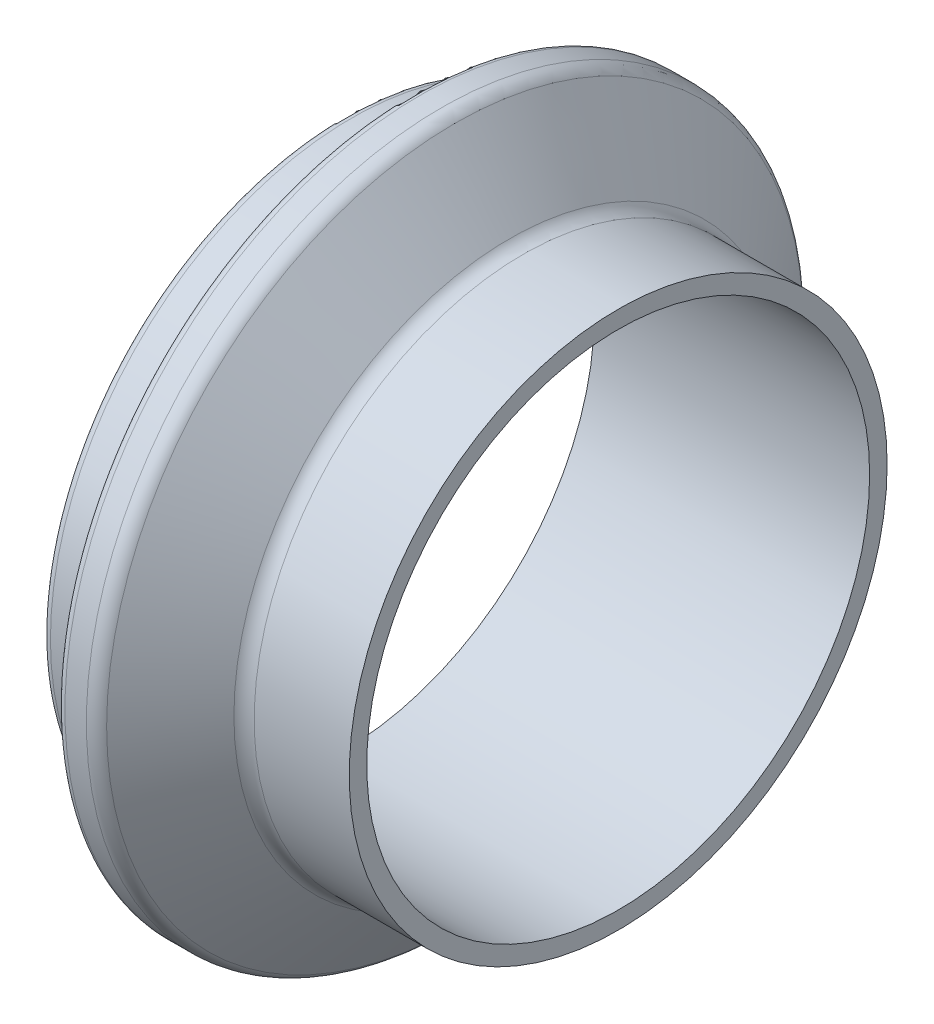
from build123d import *


with BuildPart() as part:
    # Sketch1 → Revolve1 (revolve)
    with BuildSketch(Plane.XY, mode=Mode.PRIVATE) as revolve1_sk:
        with BuildLine():
            Line((0, 23.749), (-26.0096, 23.749))
            Line((-26.0096, 23.749), (-26.0096, 27.6098))
            ThreePointArc((-26.0096, 27.6098), (-25.771536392, 28.184536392), (-25.1968, 28.4226))
            Line((-25.1968, 28.4226), (-20.3454, 28.4226))
            ThreePointArc((-20.3454, 28.4226), (-19.770663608, 28.660663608), (-19.5326, 29.2354))
            Line((-19.5326, 29.2354), (-19.5326, 32.7152))
            ThreePointArc((-19.5326, 32.7152), (-19.294536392, 33.289936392), (-18.7198, 33.528))
            Line((-18.7198, 33.528), (-16.698230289, 33.528))
            ThreePointArc((-16.698230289, 33.528), (-15.984224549, 33.359873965), (-15.420253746, 32.8908244))
            Line((-15.420253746, 32.8908244), (-10.255658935, 26.0371756))
            ThreePointArc((-10.255658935, 26.0371756), (-9.691688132, 25.568126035), (-8.977682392, 25.4))
            Line((-8.977682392, 25.4), (0, 25.4))
            Line((0, 25.4), (0, 23.749))
        make_face()
    revolve(revolve1_sk.sketch.rotate(Axis((0, 0, 0), (-1, 0, 0)), 90), axis=Axis((0, 0, 0), (-1, 0, 0)))


solid = part.part
